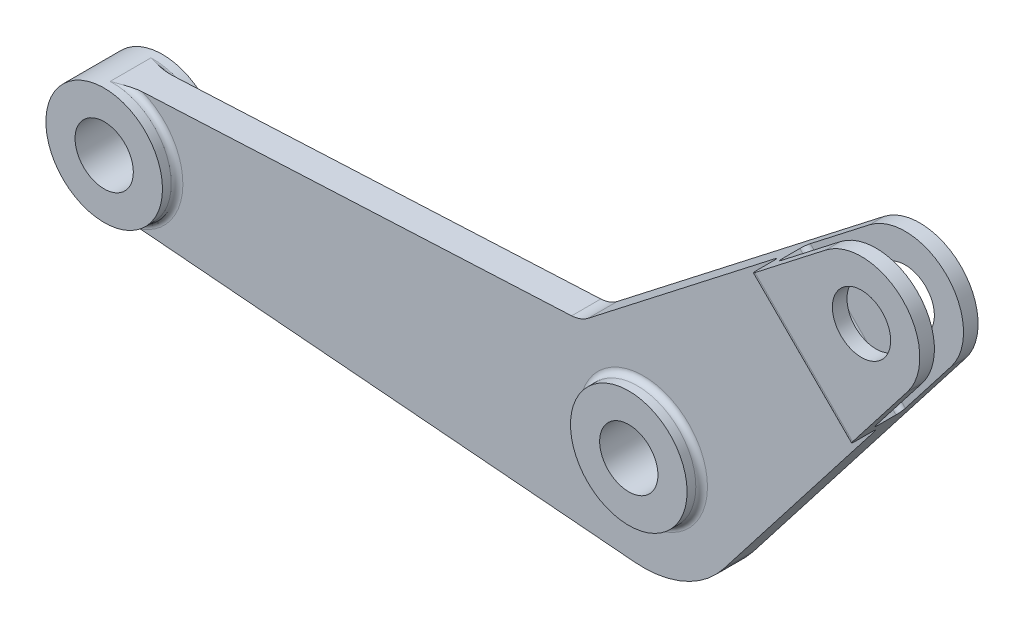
ISO-10303-21;
HEADER;
FILE_DESCRIPTION(('STEP AP214'),'2;1');
FILE_NAME('part.step','',(''),(''),'','','');
FILE_SCHEMA(('AUTOMOTIVE_DESIGN { 1 0 10303 214 1 1 1 1 }'));
ENDSEC;
DATA;
#1=APPLICATION_CONTEXT('core data for automotive mechanical design processes');
#2=APPLICATION_PROTOCOL_DEFINITION('international standard','automotive_design',2000,#1);
#3=PRODUCT_CONTEXT('',#1,'mechanical');
#4=PRODUCT('Part','Part','',(#3));
#5=PRODUCT_RELATED_PRODUCT_CATEGORY('part','',(#4));
#6=PRODUCT_DEFINITION_FORMATION('','',#4);
#7=PRODUCT_DEFINITION_CONTEXT('part definition',#1,'design');
#8=PRODUCT_DEFINITION('design','',#6,#7);
#9=PRODUCT_DEFINITION_SHAPE('','',#8);
#10=(LENGTH_UNIT() NAMED_UNIT(*) SI_UNIT(.MILLI.,.METRE.));
#11=(NAMED_UNIT(*) PLANE_ANGLE_UNIT() SI_UNIT($,.RADIAN.));
#12=(NAMED_UNIT(*) SI_UNIT($,.STERADIAN.) SOLID_ANGLE_UNIT());
#13=UNCERTAINTY_MEASURE_WITH_UNIT(LENGTH_MEASURE(1.E-05),#10,'distance_accuracy_value','');
#14=(GEOMETRIC_REPRESENTATION_CONTEXT(3) GLOBAL_UNCERTAINTY_ASSIGNED_CONTEXT((#13)) GLOBAL_UNIT_ASSIGNED_CONTEXT((#10,
#11,#12)) REPRESENTATION_CONTEXT('',''));
#15=CARTESIAN_POINT('',(0.,0.,0.));
#16=DIRECTION('',(0.,0.,1.));
#17=DIRECTION('',(1.,0.,0.));
#18=AXIS2_PLACEMENT_3D('',#15,#16,#17);
#19=CARTESIAN_POINT('',(84.8528137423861,84.8528137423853,5.));
#20=DIRECTION('',(0.,0.,-1.));
#21=DIRECTION('',(-1.,0.,0.));
#22=AXIS2_PLACEMENT_3D('',#19,#20,#21);
#23=CYLINDRICAL_SURFACE('',#22,20.);
#24=CARTESIAN_POINT('',(84.8528137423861,84.8528137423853,10.));
#25=DIRECTION('',(0.,0.,1.));
#26=DIRECTION('',(1.,0.,0.));
#27=AXIS2_PLACEMENT_3D('',#24,#25,#26);
#28=CIRCLE('',#27,20.);
#29=CARTESIAN_POINT('',(100.651795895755,72.5893654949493,10.));
#30=VERTEX_POINT('',#29);
#31=CARTESIAN_POINT('',(72.5893654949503,100.651795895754,10.));
#32=VERTEX_POINT('',#31);
#33=EDGE_CURVE('E448',#30,#32,#28,.T.);
#34=ORIENTED_EDGE('',*,*,#33,.T.);
#35=DIRECTION('',(0.,0.,-1.));
#36=VECTOR('',#35,1.);
#37=CARTESIAN_POINT('',(72.5893654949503,100.651795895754,5.));
#38=LINE('',#37,#36);
#39=CARTESIAN_POINT('',(72.5893654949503,100.651795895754,15.));
#40=VERTEX_POINT('',#39);
#41=EDGE_CURVE('E198',#40,#32,#38,.T.);
#42=ORIENTED_EDGE('',*,*,#41,.F.);
#43=CARTESIAN_POINT('',(84.8528137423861,84.8528137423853,15.));
#44=DIRECTION('',(0.,0.,1.));
#45=DIRECTION('',(1.,0.,0.));
#46=AXIS2_PLACEMENT_3D('',#43,#44,#45);
#47=CIRCLE('',#46,20.);
#48=CARTESIAN_POINT('',(100.651795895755,72.5893654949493,15.));
#49=VERTEX_POINT('',#48);
#50=EDGE_CURVE('E443',#49,#40,#47,.T.);
#51=ORIENTED_EDGE('',*,*,#50,.F.);
#52=DIRECTION('',(0.,0.,-1.));
#53=VECTOR('',#52,1.);
#54=CARTESIAN_POINT('',(100.651795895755,72.5893654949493,5.));
#55=LINE('',#54,#53);
#56=EDGE_CURVE('E197',#49,#30,#55,.T.);
#57=ORIENTED_EDGE('',*,*,#56,.T.);
#58=EDGE_LOOP('',(#34,#42,#51,#57));
#59=FACE_BOUND('',#58,.T.);
#60=ADVANCED_FACE('F33',(#59),#23,.T.);
#61=CARTESIAN_POINT('',(-180.,0.,5.));
#62=DIRECTION('',(0.,0.,1.));
#63=DIRECTION('',(1.,0.,0.));
#64=AXIS2_PLACEMENT_3D('',#61,#62,#63);
#65=PLANE('',#64);
#66=CARTESIAN_POINT('',(0.,0.,5.));
#67=DIRECTION('',(0.,0.,1.));
#68=DIRECTION('',(1.,0.,0.));
#69=AXIS2_PLACEMENT_3D('',#66,#67,#68);
#70=CIRCLE('',#69,22.);
#71=CARTESIAN_POINT('',(22.,0.,5.));
#72=VERTEX_POINT('',#71);
#73=EDGE_CURVE('E256',#72,#72,#70,.F.);
#74=ORIENTED_EDGE('',*,*,#73,.T.);
#75=EDGE_LOOP('',(#74));
#76=FACE_BOUND('',#75,.T.);
#77=DIRECTION('',(0.6131724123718,0.789949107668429,0.));
#78=VECTOR('',#77,1.);
#79=CARTESIAN_POINT('',(27.648218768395,-21.461034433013,5.));
#80=LINE('',#79,#78);
#81=CARTESIAN_POINT('',(27.648218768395,-21.461034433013,5.));
#82=VERTEX_POINT('',#81);
#83=CARTESIAN_POINT('',(79.3301162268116,45.1206772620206,5.));
#84=VERTEX_POINT('',#83);
#85=EDGE_CURVE('E378',#82,#84,#80,.T.);
#86=ORIENTED_EDGE('',*,*,#85,.T.);
#87=DIRECTION('',(-0.707106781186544,0.707106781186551,0.));
#88=VECTOR('',#87,1.);
#89=CARTESIAN_POINT('',(-27.7746032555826,152.225396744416,5.));
#90=LINE('',#89,#88);
#91=CARTESIAN_POINT('',(45.1206772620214,79.3301162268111,5.));
#92=VERTEX_POINT('',#91);
#93=EDGE_CURVE('E259',#84,#92,#90,.T.);
#94=ORIENTED_EDGE('',*,*,#93,.T.);
#95=DIRECTION('',(-0.789949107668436,-0.613172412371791,0.));
#96=VECTOR('',#95,1.);
#97=CARTESIAN_POINT('',(-21.4610344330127,27.6482187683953,5.));
#98=LINE('',#97,#96);
#99=CARTESIAN_POINT('',(-18.9653568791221,29.5854076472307,5.));
#100=VERTEX_POINT('',#99);
#101=EDGE_CURVE('E398',#92,#100,#98,.T.);
#102=ORIENTED_EDGE('',*,*,#101,.T.);
#103=CARTESIAN_POINT('',(-25.09708100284,37.484898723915,5.));
#104=DIRECTION('',(0.,0.,1.));
#105=DIRECTION('',(1.,0.,0.));
#106=AXIS2_PLACEMENT_3D('',#103,#104,#105);
#107=CIRCLE('',#106,10.);
#108=CARTESIAN_POINT('',(-24.6166757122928,27.4964448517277,5.));
#109=VERTEX_POINT('',#108);
#110=EDGE_CURVE('E11',#100,#109,#107,.F.);
#111=ORIENTED_EDGE('',*,*,#110,.T.);
#112=DIRECTION('',(-0.998845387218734,-0.0480405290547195,0.));
#113=VECTOR('',#112,1.);
#114=CARTESIAN_POINT('',(-21.4610344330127,27.6482187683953,5.));
#115=LINE('',#114,#113);
#116=CARTESIAN_POINT('',(-171.80624139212,20.4172064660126,5.));
#117=VERTEX_POINT('',#116);
#118=EDGE_CURVE('E384',#109,#117,#115,.T.);
#119=ORIENTED_EDGE('',*,*,#118,.T.);
#120=CARTESIAN_POINT('',(-180.,0.,5.));
#121=DIRECTION('',(0.,0.,1.));
#122=DIRECTION('',(1.,0.,0.));
#123=AXIS2_PLACEMENT_3D('',#120,#121,#122);
#124=CIRCLE('',#123,22.);
#125=CARTESIAN_POINT('',(-172.533394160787,-20.6941971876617,5.));
#126=VERTEX_POINT('',#125);
#127=EDGE_CURVE('E253',#117,#126,#124,.F.);
#128=ORIENTED_EDGE('',*,*,#127,.T.);
#129=DIRECTION('',(0.996521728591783,-0.0833333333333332,0.));
#130=VECTOR('',#129,1.);
#131=CARTESIAN_POINT('',(-181.666666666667,-19.9304345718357,5.));
#132=LINE('',#131,#130);
#133=CARTESIAN_POINT('',(-2.91666666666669,-34.8782605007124,5.));
#134=VERTEX_POINT('',#133);
#135=EDGE_CURVE('E385',#126,#134,#132,.T.);
#136=ORIENTED_EDGE('',*,*,#135,.T.);
#137=CARTESIAN_POINT('',(0.,0.,5.));
#138=DIRECTION('',(0.,0.,1.));
#139=DIRECTION('',(1.,0.,0.));
#140=AXIS2_PLACEMENT_3D('',#137,#138,#139);
#141=CIRCLE('',#140,35.);
#142=EDGE_CURVE('E390',#134,#82,#141,.T.);
#143=ORIENTED_EDGE('',*,*,#142,.T.);
#144=EDGE_LOOP('',(#86,#94,#102,#111,#119,#128,#136,#143));
#145=FACE_BOUND('',#144,.T.);
#146=ADVANCED_FACE('F345',(#76,#145),#65,.T.);
#147=CARTESIAN_POINT('',(-21.4610344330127,27.6482187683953,5.));
#148=DIRECTION('',(0.0480405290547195,-0.998845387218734,0.));
#149=DIRECTION('',(0.998845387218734,0.0480405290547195,0.));
#150=AXIS2_PLACEMENT_3D('',#147,#148,#149);
#151=PLANE('',#150);
#152=ORIENTED_EDGE('',*,*,#118,.F.);
#153=DIRECTION('',(0.,0.,-1.));
#154=VECTOR('',#153,1.);
#155=CARTESIAN_POINT('',(-24.6166757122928,27.4964448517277,-5.));
#156=LINE('',#155,#154);
#157=CARTESIAN_POINT('',(-24.6166757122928,27.4964448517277,-5.));
#158=VERTEX_POINT('',#157);
#159=EDGE_CURVE('E411',#109,#158,#156,.T.);
#160=ORIENTED_EDGE('',*,*,#159,.T.);
#161=DIRECTION('',(-0.998845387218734,-0.0480405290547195,0.));
#162=VECTOR('',#161,1.);
#163=CARTESIAN_POINT('',(-21.4610344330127,27.6482187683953,-5.));
#164=LINE('',#163,#162);
#165=CARTESIAN_POINT('',(-171.80624139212,20.4172064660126,-5.));
#166=VERTEX_POINT('',#165);
#167=EDGE_CURVE('E400',#158,#166,#164,.T.);
#168=ORIENTED_EDGE('',*,*,#167,.T.);
#169=CARTESIAN_POINT('',(-171.80624139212,20.4172064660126,-5.));
#170=CARTESIAN_POINT('',(-171.975211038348,20.409079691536,-5.00002700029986));
#171=CARTESIAN_POINT('',(-172.144144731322,20.4009546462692,-5.00372364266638));
#172=CARTESIAN_POINT('',(-172.481686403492,20.3847202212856,-5.01764297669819));
#173=CARTESIAN_POINT('',(-172.650294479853,20.3766108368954,-5.02786326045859));
#174=CARTESIAN_POINT('',(-172.986775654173,20.3604274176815,-5.05399608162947));
#175=CARTESIAN_POINT('',(-173.154649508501,20.3523533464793,-5.06989911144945));
#176=CARTESIAN_POINT('',(-173.489853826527,20.336231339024,-5.10675267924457));
#177=CARTESIAN_POINT('',(-173.657184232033,20.3281834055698,-5.12770374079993));
#178=CARTESIAN_POINT('',(-174.156249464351,20.3041803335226,-5.19697248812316));
#179=CARTESIAN_POINT('',(-174.487078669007,20.2882687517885,-5.25187726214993));
#180=CARTESIAN_POINT('',(-175.146228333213,20.256566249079,-5.37560501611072));
#181=CARTESIAN_POINT('',(-175.474547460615,20.2407753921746,-5.44443491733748));
#182=CARTESIAN_POINT('',(-176.235285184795,20.2041869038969,-5.61719451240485));
#183=CARTESIAN_POINT('',(-176.666761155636,20.1834346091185,-5.72525296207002));
#184=CARTESIAN_POINT('',(-177.526162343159,20.1421007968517,-5.95477561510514));
#185=CARTESIAN_POINT('',(-177.954086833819,20.1215193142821,-6.07624249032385));
#186=CARTESIAN_POINT('',(-179.235222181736,20.0599017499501,-6.45375068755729));
#187=CARTESIAN_POINT('',(-180.084608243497,20.0190496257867,-6.72260082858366));
#188=CARTESIAN_POINT('',(-180.942852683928,19.9777714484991,-6.99431466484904));
#189=CARTESIAN_POINT('',(-180.951831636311,19.9773395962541,-6.99715734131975));
#190=CARTESIAN_POINT('',(-180.960810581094,19.9769077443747,-7.));
#191=B_SPLINE_CURVE_WITH_KNOTS('',3,(#169,#170,#171,#172,#173,#174,#175,#176,#177,#178,#179,
#180,#181,#182,#183,#184,#185,#186,#187,#188,#189,#190),.UNSPECIFIED.,.F.,.F.,(4,2,2,2,2,2,2,2,
2,2,4),(0.,0.507403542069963,1.01461990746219,1.52099161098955,2.02741585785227,
3.03418305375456,4.04145188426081,5.37696765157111,6.71275002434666,9.38798628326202,
9.41627055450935),.UNSPECIFIED.);
#192=CARTESIAN_POINT('',(-180.960810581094,19.9769077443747,-7.));
#193=VERTEX_POINT('',#192);
#194=EDGE_CURVE('E301',#166,#193,#191,.T.);
#195=ORIENTED_EDGE('',*,*,#194,.T.);
#196=DIRECTION('',(0.,0.,-1.));
#197=VECTOR('',#196,1.);
#198=CARTESIAN_POINT('',(-180.960810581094,19.9769077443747,5.));
#199=LINE('',#198,#197);
#200=CARTESIAN_POINT('',(-180.960810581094,19.9769077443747,7.));
#201=VERTEX_POINT('',#200);
#202=EDGE_CURVE('E212',#201,#193,#199,.T.);
#203=ORIENTED_EDGE('',*,*,#202,.F.);
#204=CARTESIAN_POINT('',(-171.80624139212,20.4172064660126,5.));
#205=CARTESIAN_POINT('',(-171.975211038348,20.409079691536,5.00002700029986));
#206=CARTESIAN_POINT('',(-172.144144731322,20.4009546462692,5.00372364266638));
#207=CARTESIAN_POINT('',(-172.481686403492,20.3847202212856,5.01764297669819));
#208=CARTESIAN_POINT('',(-172.650294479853,20.3766108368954,5.02786326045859));
#209=CARTESIAN_POINT('',(-172.986775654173,20.3604274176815,5.05399608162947));
#210=CARTESIAN_POINT('',(-173.154649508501,20.3523533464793,5.06989911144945));
#211=CARTESIAN_POINT('',(-173.489853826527,20.336231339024,5.10675267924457));
#212=CARTESIAN_POINT('',(-173.657184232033,20.3281834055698,5.12770374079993));
#213=CARTESIAN_POINT('',(-174.156249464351,20.3041803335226,5.19697248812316));
#214=CARTESIAN_POINT('',(-174.487078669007,20.2882687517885,5.25187726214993));
#215=CARTESIAN_POINT('',(-175.146228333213,20.256566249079,5.37560501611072));
#216=CARTESIAN_POINT('',(-175.474547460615,20.2407753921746,5.44443491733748));
#217=CARTESIAN_POINT('',(-176.235285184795,20.2041869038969,5.61719451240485));
#218=CARTESIAN_POINT('',(-176.666761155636,20.1834346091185,5.72525296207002));
#219=CARTESIAN_POINT('',(-177.526162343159,20.1421007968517,5.95477561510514));
#220=CARTESIAN_POINT('',(-177.954086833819,20.1215193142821,6.07624249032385));
#221=CARTESIAN_POINT('',(-179.235222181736,20.0599017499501,6.45375068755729));
#222=CARTESIAN_POINT('',(-180.084608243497,20.0190496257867,6.72260082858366));
#223=CARTESIAN_POINT('',(-180.942852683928,19.9777714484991,6.99431466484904));
#224=CARTESIAN_POINT('',(-180.951831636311,19.9773395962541,6.99715734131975));
#225=CARTESIAN_POINT('',(-180.960810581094,19.9769077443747,7.));
#226=B_SPLINE_CURVE_WITH_KNOTS('',3,(#204,#205,#206,#207,#208,#209,#210,#211,#212,#213,#214,
#215,#216,#217,#218,#219,#220,#221,#222,#223,#224,#225),.UNSPECIFIED.,.F.,.F.,(4,2,2,2,2,2,2,2,
2,2,4),(0.,0.507403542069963,1.01461990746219,1.52099161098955,2.02741585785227,
3.03418305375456,4.04145188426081,5.37696765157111,6.71275002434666,9.38798628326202,
9.41627055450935),.UNSPECIFIED.);
#227=EDGE_CURVE('E326',#201,#117,#226,.F.);
#228=ORIENTED_EDGE('',*,*,#227,.T.);
#229=EDGE_LOOP('',(#152,#160,#168,#195,#203,#228));
#230=FACE_BOUND('',#229,.T.);
#231=ADVANCED_FACE('F351',(#230),#151,.F.);
#232=CARTESIAN_POINT('',(-180.,0.,5.));
#233=DIRECTION('',(0.,0.,-1.));
#234=DIRECTION('',(-1.,0.,0.));
#235=AXIS2_PLACEMENT_3D('',#232,#233,#234);
#236=CYLINDRICAL_SURFACE('',#235,20.);
#237=CARTESIAN_POINT('',(-180.,0.,-7.));
#238=DIRECTION('',(0.,0.,1.));
#239=DIRECTION('',(1.,0.,0.));
#240=AXIS2_PLACEMENT_3D('',#237,#238,#239);
#241=CIRCLE('',#240,20.);
#242=CARTESIAN_POINT('',(-181.666666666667,-19.9304345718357,-7.));
#243=VERTEX_POINT('',#242);
#244=EDGE_CURVE('E279',#193,#243,#241,.F.);
#245=ORIENTED_EDGE('',*,*,#244,.T.);
#246=DIRECTION('',(0.,0.,-1.));
#247=VECTOR('',#246,1.);
#248=CARTESIAN_POINT('',(-181.666666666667,-19.9304345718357,5.));
#249=LINE('',#248,#247);
#250=CARTESIAN_POINT('',(-181.666666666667,-19.9304345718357,7.));
#251=VERTEX_POINT('',#250);
#252=EDGE_CURVE('E210',#251,#243,#249,.T.);
#253=ORIENTED_EDGE('',*,*,#252,.F.);
#254=CARTESIAN_POINT('',(-180.,0.,7.));
#255=DIRECTION('',(0.,0.,1.));
#256=DIRECTION('',(1.,0.,0.));
#257=AXIS2_PLACEMENT_3D('',#254,#255,#256);
#258=CIRCLE('',#257,20.);
#259=EDGE_CURVE('E276',#251,#201,#258,.T.);
#260=ORIENTED_EDGE('',*,*,#259,.T.);
#261=ORIENTED_EDGE('',*,*,#202,.T.);
#262=EDGE_LOOP('',(#245,#253,#260,#261));
#263=FACE_BOUND('',#262,.T.);
#264=CARTESIAN_POINT('',(-180.,0.,-10.));
#265=DIRECTION('',(0.,0.,1.));
#266=DIRECTION('',(1.,0.,0.));
#267=AXIS2_PLACEMENT_3D('',#264,#265,#266);
#268=CIRCLE('',#267,20.);
#269=CARTESIAN_POINT('',(-160.,0.,-10.));
#270=VERTEX_POINT('',#269);
#271=EDGE_CURVE('E393',#270,#270,#268,.T.);
#272=ORIENTED_EDGE('',*,*,#271,.T.);
#273=EDGE_LOOP('',(#272));
#274=FACE_BOUND('',#273,.T.);
#275=CARTESIAN_POINT('',(-180.,0.,10.));
#276=DIRECTION('',(0.,0.,1.));
#277=DIRECTION('',(1.,0.,0.));
#278=AXIS2_PLACEMENT_3D('',#275,#276,#277);
#279=CIRCLE('',#278,20.);
#280=CARTESIAN_POINT('',(-160.,0.,10.));
#281=VERTEX_POINT('',#280);
#282=EDGE_CURVE('E401',#281,#281,#279,.T.);
#283=ORIENTED_EDGE('',*,*,#282,.F.);
#284=EDGE_LOOP('',(#283));
#285=FACE_BOUND('',#284,.T.);
#286=ADVANCED_FACE('F316',(#263,#274,#285),#236,.T.);
#287=CARTESIAN_POINT('',(-181.666666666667,-19.9304345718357,5.));
#288=DIRECTION('',(0.0833333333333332,0.996521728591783,0.));
#289=DIRECTION('',(-0.996521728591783,0.0833333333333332,0.));
#290=AXIS2_PLACEMENT_3D('',#287,#288,#289);
#291=PLANE('',#290);
#292=ORIENTED_EDGE('',*,*,#252,.T.);
#293=CARTESIAN_POINT('',(-172.533394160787,-20.6941971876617,-5.));
#294=CARTESIAN_POINT('',(-172.701970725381,-20.68010010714,-5.00002700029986));
#295=CARTESIAN_POINT('',(-172.870511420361,-20.6660060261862,-5.00372364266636));
#296=CARTESIAN_POINT('',(-173.207267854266,-20.637845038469,-5.01764297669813));
#297=CARTESIAN_POINT('',(-173.37548369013,-20.6237781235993,-5.02786326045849));
#298=CARTESIAN_POINT('',(-173.711182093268,-20.5957056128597,-5.05399608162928));
#299=CARTESIAN_POINT('',(-173.878665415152,-20.5816999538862,-5.06989911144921));
#300=CARTESIAN_POINT('',(-174.213089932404,-20.5537339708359,-5.10675267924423));
#301=CARTESIAN_POINT('',(-174.380031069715,-20.5397736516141,-5.12770374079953));
#302=CARTESIAN_POINT('',(-174.877935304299,-20.4981368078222,-5.19697248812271));
#303=CARTESIAN_POINT('',(-175.207994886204,-20.4705358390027,-5.25187726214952));
#304=CARTESIAN_POINT('',(-175.865611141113,-20.4155432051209,-5.37560501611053));
#305=CARTESIAN_POINT('',(-176.193166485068,-20.3881516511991,-5.44443491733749));
#306=CARTESIAN_POINT('',(-176.952134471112,-20.3246835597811,-5.61719451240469));
#307=CARTESIAN_POINT('',(-177.382606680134,-20.2886856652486,-5.72525296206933));
#308=CARTESIAN_POINT('',(-178.240008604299,-20.2169861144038,-5.95477561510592));
#309=CARTESIAN_POINT('',(-178.666937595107,-20.1812845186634,-6.07624249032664));
#310=CARTESIAN_POINT('',(-179.945092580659,-20.0743998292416,-6.45375068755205));
#311=CARTESIAN_POINT('',(-180.792502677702,-20.0035358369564,-6.72260082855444));
#312=CARTESIAN_POINT('',(-181.648750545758,-19.9319327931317,-6.99431466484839));
#313=CARTESIAN_POINT('',(-181.657708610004,-19.9311836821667,-6.99715734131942));
#314=CARTESIAN_POINT('',(-181.666666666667,-19.9304345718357,-7.));
#315=B_SPLINE_CURVE_WITH_KNOTS('',3,(#293,#294,#295,#296,#297,#298,#299,#300,#301,#302,#303,
#304,#305,#306,#307,#308,#309,#310,#311,#312,#313,#314),.UNSPECIFIED.,.F.,.F.,(4,2,2,2,2,2,2,2,
2,2,4),(0.,0.507403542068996,1.01461990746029,1.52099161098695,2.02741585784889,
3.03418305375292,4.04145188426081,5.37696765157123,6.71275002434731,9.38798628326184,
9.41627055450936),.UNSPECIFIED.);
#316=CARTESIAN_POINT('',(-172.533394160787,-20.6941971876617,-5.));
#317=VERTEX_POINT('',#316);
#318=EDGE_CURVE('E294',#243,#317,#315,.F.);
#319=ORIENTED_EDGE('',*,*,#318,.T.);
#320=DIRECTION('',(0.996521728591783,-0.0833333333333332,0.));
#321=VECTOR('',#320,1.);
#322=CARTESIAN_POINT('',(-181.666666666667,-19.9304345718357,-5.));
#323=LINE('',#322,#321);
#324=CARTESIAN_POINT('',(-2.91666666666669,-34.8782605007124,-5.));
#325=VERTEX_POINT('',#324);
#326=EDGE_CURVE('E375',#317,#325,#323,.T.);
#327=ORIENTED_EDGE('',*,*,#326,.T.);
#328=DIRECTION('',(0.,0.,-1.));
#329=VECTOR('',#328,1.);
#330=CARTESIAN_POINT('',(-2.91666666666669,-34.8782605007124,5.));
#331=LINE('',#330,#329);
#332=EDGE_CURVE('E207',#134,#325,#331,.T.);
#333=ORIENTED_EDGE('',*,*,#332,.F.);
#334=ORIENTED_EDGE('',*,*,#135,.F.);
#335=CARTESIAN_POINT('',(-172.533394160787,-20.6941971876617,5.));
#336=CARTESIAN_POINT('',(-172.701970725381,-20.68010010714,5.00002700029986));
#337=CARTESIAN_POINT('',(-172.870511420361,-20.6660060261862,5.00372364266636));
#338=CARTESIAN_POINT('',(-173.207267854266,-20.637845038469,5.01764297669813));
#339=CARTESIAN_POINT('',(-173.37548369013,-20.6237781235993,5.02786326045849));
#340=CARTESIAN_POINT('',(-173.711182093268,-20.5957056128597,5.05399608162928));
#341=CARTESIAN_POINT('',(-173.878665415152,-20.5816999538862,5.06989911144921));
#342=CARTESIAN_POINT('',(-174.213089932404,-20.5537339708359,5.10675267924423));
#343=CARTESIAN_POINT('',(-174.380031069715,-20.5397736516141,5.12770374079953));
#344=CARTESIAN_POINT('',(-174.877935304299,-20.4981368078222,5.19697248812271));
#345=CARTESIAN_POINT('',(-175.207994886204,-20.4705358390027,5.25187726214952));
#346=CARTESIAN_POINT('',(-175.865611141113,-20.4155432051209,5.37560501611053));
#347=CARTESIAN_POINT('',(-176.193166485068,-20.3881516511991,5.44443491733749));
#348=CARTESIAN_POINT('',(-176.952134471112,-20.3246835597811,5.61719451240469));
#349=CARTESIAN_POINT('',(-177.382606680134,-20.2886856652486,5.72525296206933));
#350=CARTESIAN_POINT('',(-178.240008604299,-20.2169861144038,5.95477561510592));
#351=CARTESIAN_POINT('',(-178.666937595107,-20.1812845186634,6.07624249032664));
#352=CARTESIAN_POINT('',(-179.945092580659,-20.0743998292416,6.45375068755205));
#353=CARTESIAN_POINT('',(-180.792502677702,-20.0035358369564,6.72260082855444));
#354=CARTESIAN_POINT('',(-181.648750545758,-19.9319327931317,6.99431466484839));
#355=CARTESIAN_POINT('',(-181.657708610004,-19.9311836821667,6.99715734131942));
#356=CARTESIAN_POINT('',(-181.666666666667,-19.9304345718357,7.));
#357=B_SPLINE_CURVE_WITH_KNOTS('',3,(#335,#336,#337,#338,#339,#340,#341,#342,#343,#344,#345,
#346,#347,#348,#349,#350,#351,#352,#353,#354,#355,#356),.UNSPECIFIED.,.F.,.F.,(4,2,2,2,2,2,2,2,
2,2,4),(0.,0.507403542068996,1.01461990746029,1.52099161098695,2.02741585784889,
3.03418305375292,4.04145188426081,5.37696765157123,6.71275002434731,9.38798628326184,
9.41627055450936),.UNSPECIFIED.);
#358=EDGE_CURVE('E320',#126,#251,#357,.T.);
#359=ORIENTED_EDGE('',*,*,#358,.T.);
#360=EDGE_LOOP('',(#292,#319,#327,#333,#334,#359));
#361=FACE_BOUND('',#360,.T.);
#362=ADVANCED_FACE('F310',(#361),#291,.F.);
#363=CARTESIAN_POINT('',(0.,0.,5.));
#364=DIRECTION('',(0.,0.,-1.));
#365=DIRECTION('',(-1.,0.,0.));
#366=AXIS2_PLACEMENT_3D('',#363,#364,#365);
#367=CYLINDRICAL_SURFACE('',#366,35.);
#368=CARTESIAN_POINT('',(0.,0.,-5.));
#369=DIRECTION('',(0.,0.,1.));
#370=DIRECTION('',(1.,0.,0.));
#371=AXIS2_PLACEMENT_3D('',#368,#369,#370);
#372=CIRCLE('',#371,35.);
#373=CARTESIAN_POINT('',(27.648218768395,-21.461034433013,-5.));
#374=VERTEX_POINT('',#373);
#375=EDGE_CURVE('E370',#325,#374,#372,.T.);
#376=ORIENTED_EDGE('',*,*,#375,.T.);
#377=DIRECTION('',(0.,0.,-1.));
#378=VECTOR('',#377,1.);
#379=CARTESIAN_POINT('',(27.648218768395,-21.461034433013,5.));
#380=LINE('',#379,#378);
#381=EDGE_CURVE('E201',#82,#374,#380,.T.);
#382=ORIENTED_EDGE('',*,*,#381,.F.);
#383=ORIENTED_EDGE('',*,*,#142,.F.);
#384=ORIENTED_EDGE('',*,*,#332,.T.);
#385=EDGE_LOOP('',(#376,#382,#383,#384));
#386=FACE_BOUND('',#385,.T.);
#387=ADVANCED_FACE('F315',(#386),#367,.T.);
#388=CARTESIAN_POINT('',(27.648218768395,-21.461034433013,5.));
#389=DIRECTION('',(-0.789949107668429,0.6131724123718,0.));
#390=DIRECTION('',(-0.6131724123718,-0.789949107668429,0.));
#391=AXIS2_PLACEMENT_3D('',#388,#389,#390);
#392=PLANE('',#391);
#393=DIRECTION('',(0.613172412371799,0.789949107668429,0.));
#394=VECTOR('',#393,1.);
#395=CARTESIAN_POINT('',(80.5661556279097,46.7130649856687,15.));
#396=LINE('',#395,#394);
#397=CARTESIAN_POINT('',(81.8021950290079,48.3054527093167,15.));
#398=VERTEX_POINT('',#397);
#399=EDGE_CURVE('E438',#398,#49,#396,.T.);
#400=ORIENTED_EDGE('',*,*,#399,.F.);
#401=CARTESIAN_POINT('',(81.8021950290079,48.3054527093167,13.));
#402=DIRECTION('',(-0.789949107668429,0.6131724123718,0.));
#403=DIRECTION('',(0.6131724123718,0.789949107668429,0.));
#404=AXIS2_PLACEMENT_3D('',#401,#402,#403);
#405=ELLIPSE('',#404,2.01581052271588,2.);
#406=CARTESIAN_POINT('',(80.5661556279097,46.7130649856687,13.));
#407=VERTEX_POINT('',#406);
#408=EDGE_CURVE('E269',#398,#407,#405,.F.);
#409=ORIENTED_EDGE('',*,*,#408,.T.);
#410=DIRECTION('',(0.,0.,-1.));
#411=VECTOR('',#410,1.);
#412=CARTESIAN_POINT('',(80.5661556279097,46.7130649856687,15.));
#413=LINE('',#412,#411);
#414=CARTESIAN_POINT('',(80.5661556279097,46.7130649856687,7.));
#415=VERTEX_POINT('',#414);
#416=EDGE_CURVE('E435',#407,#415,#413,.T.);
#417=ORIENTED_EDGE('',*,*,#416,.T.);
#418=CARTESIAN_POINT('',(79.3301162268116,45.1206772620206,7.));
#419=DIRECTION('',(-0.789949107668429,0.6131724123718,0.));
#420=DIRECTION('',(0.6131724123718,0.789949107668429,0.));
#421=AXIS2_PLACEMENT_3D('',#418,#419,#420);
#422=ELLIPSE('',#421,2.01581052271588,2.);
#423=EDGE_CURVE('E292',#415,#84,#422,.T.);
#424=ORIENTED_EDGE('',*,*,#423,.T.);
#425=ORIENTED_EDGE('',*,*,#85,.F.);
#426=ORIENTED_EDGE('',*,*,#381,.T.);
#427=DIRECTION('',(0.6131724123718,0.789949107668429,0.));
#428=VECTOR('',#427,1.);
#429=CARTESIAN_POINT('',(27.648218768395,-21.461034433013,-5.));
#430=LINE('',#429,#428);
#431=CARTESIAN_POINT('',(100.651795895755,72.5893654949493,-5.));
#432=VERTEX_POINT('',#431);
#433=EDGE_CURVE('E195',#374,#432,#430,.T.);
#434=ORIENTED_EDGE('',*,*,#433,.T.);
#435=CARTESIAN_POINT('',(100.651795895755,72.5893654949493,0.));
#436=VERTEX_POINT('',#435);
#437=EDGE_CURVE('E186',#436,#432,#55,.T.);
#438=ORIENTED_EDGE('',*,*,#437,.F.);
#439=DIRECTION('',(-0.6131724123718,-0.78994910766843,0.));
#440=VECTOR('',#439,1.);
#441=CARTESIAN_POINT('',(27.648218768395,-21.461034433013,0.));
#442=LINE('',#441,#440);
#443=CARTESIAN_POINT('',(84.8922935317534,52.286422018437,0.));
#444=VERTEX_POINT('',#443);
#445=EDGE_CURVE('E170',#436,#444,#442,.T.);
#446=ORIENTED_EDGE('',*,*,#445,.T.);
#447=CARTESIAN_POINT('',(84.8922935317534,52.286422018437,2.));
#448=DIRECTION('',(-0.789949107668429,0.6131724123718,0.));
#449=DIRECTION('',(-0.6131724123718,-0.789949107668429,0.));
#450=AXIS2_PLACEMENT_3D('',#447,#448,#449);
#451=ELLIPSE('',#450,2.01581052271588,2.);
#452=CARTESIAN_POINT('',(83.6562541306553,50.6940342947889,2.00000000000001));
#453=VERTEX_POINT('',#452);
#454=EDGE_CURVE('E288',#444,#453,#451,.T.);
#455=ORIENTED_EDGE('',*,*,#454,.T.);
#456=DIRECTION('',(0.,0.,1.));
#457=VECTOR('',#456,1.);
#458=CARTESIAN_POINT('',(83.6562541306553,50.6940342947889,5.));
#459=LINE('',#458,#457);
#460=CARTESIAN_POINT('',(83.6562541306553,50.6940342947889,8.));
#461=VERTEX_POINT('',#460);
#462=EDGE_CURVE('E181',#453,#461,#459,.T.);
#463=ORIENTED_EDGE('',*,*,#462,.T.);
#464=CARTESIAN_POINT('',(84.8922935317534,52.286422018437,8.00000000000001));
#465=DIRECTION('',(-0.789949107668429,0.6131724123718,0.));
#466=DIRECTION('',(-0.6131724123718,-0.789949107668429,0.));
#467=AXIS2_PLACEMENT_3D('',#464,#465,#466);
#468=ELLIPSE('',#467,2.01581052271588,2.);
#469=CARTESIAN_POINT('',(84.8922935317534,52.286422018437,10.));
#470=VERTEX_POINT('',#469);
#471=EDGE_CURVE('E284',#461,#470,#468,.T.);
#472=ORIENTED_EDGE('',*,*,#471,.T.);
#473=DIRECTION('',(0.6131724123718,0.78994910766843,0.));
#474=VECTOR('',#473,1.);
#475=CARTESIAN_POINT('',(27.648218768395,-21.461034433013,10.));
#476=LINE('',#475,#474);
#477=EDGE_CURVE('E446',#470,#30,#476,.T.);
#478=ORIENTED_EDGE('',*,*,#477,.T.);
#479=ORIENTED_EDGE('',*,*,#56,.F.);
#480=EDGE_LOOP('',(#400,#409,#417,#424,#425,#426,#434,#438,#446,#455,#463,#472,#478,#479));
#481=FACE_BOUND('',#480,.T.);
#482=ADVANCED_FACE('F192',(#481),#392,.F.);
#483=CARTESIAN_POINT('',(72.5893654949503,100.651795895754,0.));
#484=VERTEX_POINT('',#483);
#485=CARTESIAN_POINT('',(72.5893654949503,100.651795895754,-5.));
#486=VERTEX_POINT('',#485);
#487=EDGE_CURVE('E188',#484,#486,#38,.T.);
#488=ORIENTED_EDGE('',*,*,#487,.F.);
#489=CARTESIAN_POINT('',(84.8528137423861,84.8528137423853,0.));
#490=DIRECTION('',(0.,0.,-1.));
#491=DIRECTION('',(-1.,0.,0.));
#492=AXIS2_PLACEMENT_3D('',#489,#490,#491);
#493=CIRCLE('',#492,20.);
#494=EDGE_CURVE('E174',#484,#436,#493,.T.);
#495=ORIENTED_EDGE('',*,*,#494,.T.);
#496=ORIENTED_EDGE('',*,*,#437,.T.);
#497=CARTESIAN_POINT('',(84.8528137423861,84.8528137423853,-5.));
#498=DIRECTION('',(0.,0.,1.));
#499=DIRECTION('',(1.,0.,0.));
#500=AXIS2_PLACEMENT_3D('',#497,#498,#499);
#501=CIRCLE('',#500,20.);
#502=EDGE_CURVE('E379',#432,#486,#501,.T.);
#503=ORIENTED_EDGE('',*,*,#502,.T.);
#504=EDGE_LOOP('',(#488,#495,#496,#503));
#505=FACE_BOUND('',#504,.T.);
#506=ADVANCED_FACE('F184',(#505),#23,.T.);
#507=CARTESIAN_POINT('',(-21.4610344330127,27.6482187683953,5.));
#508=DIRECTION('',(0.613172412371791,-0.789949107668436,0.));
#509=DIRECTION('',(0.789949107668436,0.613172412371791,0.));
#510=AXIS2_PLACEMENT_3D('',#507,#508,#509);
#511=PLANE('',#510);
#512=DIRECTION('',(-0.789949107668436,-0.613172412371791,0.));
#513=VECTOR('',#512,1.);
#514=CARTESIAN_POINT('',(-21.4610344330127,27.6482187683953,-5.));
#515=LINE('',#514,#513);
#516=CARTESIAN_POINT('',(-18.9653568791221,29.5854076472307,-5.));
#517=VERTEX_POINT('',#516);
#518=EDGE_CURVE('E381',#486,#517,#515,.T.);
#519=ORIENTED_EDGE('',*,*,#518,.T.);
#520=DIRECTION('',(0.,0.,-1.));
#521=VECTOR('',#520,1.);
#522=CARTESIAN_POINT('',(-18.9653568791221,29.5854076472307,5.));
#523=LINE('',#522,#521);
#524=EDGE_CURVE('E48',#517,#100,#523,.F.);
#525=ORIENTED_EDGE('',*,*,#524,.T.);
#526=ORIENTED_EDGE('',*,*,#101,.F.);
#527=CARTESIAN_POINT('',(45.1206772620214,79.3301162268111,7.));
#528=DIRECTION('',(0.613172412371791,-0.789949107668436,0.));
#529=DIRECTION('',(-0.789949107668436,-0.613172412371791,0.));
#530=AXIS2_PLACEMENT_3D('',#527,#528,#529);
#531=ELLIPSE('',#530,2.01581052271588,2.);
#532=CARTESIAN_POINT('',(46.7130649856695,80.5661556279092,7.));
#533=VERTEX_POINT('',#532);
#534=EDGE_CURVE('E290',#92,#533,#531,.T.);
#535=ORIENTED_EDGE('',*,*,#534,.T.);
#536=DIRECTION('',(0.,0.,-1.));
#537=VECTOR('',#536,1.);
#538=CARTESIAN_POINT('',(46.7130649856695,80.5661556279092,15.));
#539=LINE('',#538,#537);
#540=CARTESIAN_POINT('',(46.7130649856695,80.5661556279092,13.));
#541=VERTEX_POINT('',#540);
#542=EDGE_CURVE('E430',#541,#533,#539,.T.);
#543=ORIENTED_EDGE('',*,*,#542,.F.);
#544=CARTESIAN_POINT('',(48.3054527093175,81.8021950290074,13.));
#545=DIRECTION('',(0.613172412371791,-0.789949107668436,0.));
#546=DIRECTION('',(-0.789949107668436,-0.613172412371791,0.));
#547=AXIS2_PLACEMENT_3D('',#544,#545,#546);
#548=ELLIPSE('',#547,2.01581052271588,2.);
#549=CARTESIAN_POINT('',(48.3054527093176,81.8021950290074,15.));
#550=VERTEX_POINT('',#549);
#551=EDGE_CURVE('E271',#541,#550,#548,.F.);
#552=ORIENTED_EDGE('',*,*,#551,.T.);
#553=DIRECTION('',(-0.789949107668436,-0.613172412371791,0.));
#554=VECTOR('',#553,1.);
#555=CARTESIAN_POINT('',(72.5893654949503,100.651795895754,15.));
#556=LINE('',#555,#554);
#557=EDGE_CURVE('E440',#40,#550,#556,.T.);
#558=ORIENTED_EDGE('',*,*,#557,.F.);
#559=ORIENTED_EDGE('',*,*,#41,.T.);
#560=DIRECTION('',(-0.789949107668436,-0.613172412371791,0.));
#561=VECTOR('',#560,1.);
#562=CARTESIAN_POINT('',(-21.4610344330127,27.6482187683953,10.));
#563=LINE('',#562,#561);
#564=CARTESIAN_POINT('',(52.2864220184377,84.8922935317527,10.));
#565=VERTEX_POINT('',#564);
#566=EDGE_CURVE('E219',#32,#565,#563,.T.);
#567=ORIENTED_EDGE('',*,*,#566,.T.);
#568=CARTESIAN_POINT('',(52.2864220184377,84.8922935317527,8.00000000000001));
#569=DIRECTION('',(0.613172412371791,-0.789949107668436,0.));
#570=DIRECTION('',(0.789949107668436,0.613172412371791,0.));
#571=AXIS2_PLACEMENT_3D('',#568,#569,#570);
#572=ELLIPSE('',#571,2.01581052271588,2.);
#573=CARTESIAN_POINT('',(50.6940342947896,83.6562541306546,8.00000000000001));
#574=VERTEX_POINT('',#573);
#575=EDGE_CURVE('E282',#565,#574,#572,.T.);
#576=ORIENTED_EDGE('',*,*,#575,.T.);
#577=DIRECTION('',(0.,0.,-1.));
#578=VECTOR('',#577,1.);
#579=CARTESIAN_POINT('',(50.6940342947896,83.6562541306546,5.));
#580=LINE('',#579,#578);
#581=CARTESIAN_POINT('',(50.6940342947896,83.6562541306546,2.));
#582=VERTEX_POINT('',#581);
#583=EDGE_CURVE('E216',#574,#582,#580,.T.);
#584=ORIENTED_EDGE('',*,*,#583,.T.);
#585=CARTESIAN_POINT('',(52.2864220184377,84.8922935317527,2.));
#586=DIRECTION('',(0.613172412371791,-0.789949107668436,0.));
#587=DIRECTION('',(0.789949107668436,0.613172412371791,0.));
#588=AXIS2_PLACEMENT_3D('',#585,#586,#587);
#589=ELLIPSE('',#588,2.01581052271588,2.);
#590=CARTESIAN_POINT('',(52.2864220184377,84.8922935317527,0.));
#591=VERTEX_POINT('',#590);
#592=EDGE_CURVE('E286',#582,#591,#589,.T.);
#593=ORIENTED_EDGE('',*,*,#592,.T.);
#594=DIRECTION('',(0.789949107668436,0.613172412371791,0.));
#595=VECTOR('',#594,1.);
#596=CARTESIAN_POINT('',(-21.4610344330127,27.6482187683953,0.));
#597=LINE('',#596,#595);
#598=EDGE_CURVE('E214',#591,#484,#597,.T.);
#599=ORIENTED_EDGE('',*,*,#598,.T.);
#600=ORIENTED_EDGE('',*,*,#487,.T.);
#601=EDGE_LOOP('',(#519,#525,#526,#535,#543,#552,#558,#559,#567,#576,#584,#593,#599,#600));
#602=FACE_BOUND('',#601,.T.);
#603=ADVANCED_FACE('F356',(#602),#511,.F.);
#604=CARTESIAN_POINT('',(-180.,0.,-5.));
#605=DIRECTION('',(0.,0.,1.));
#606=DIRECTION('',(1.,0.,0.));
#607=AXIS2_PLACEMENT_3D('',#604,#605,#606);
#608=PLANE('',#607);
#609=CARTESIAN_POINT('',(0.,0.,-5.));
#610=DIRECTION('',(0.,0.,1.));
#611=DIRECTION('',(1.,0.,0.));
#612=AXIS2_PLACEMENT_3D('',#609,#610,#611);
#613=CIRCLE('',#612,22.);
#614=CARTESIAN_POINT('',(22.,0.,-5.));
#615=VERTEX_POINT('',#614);
#616=EDGE_CURVE('E241',#615,#615,#613,.T.);
#617=ORIENTED_EDGE('',*,*,#616,.T.);
#618=EDGE_LOOP('',(#617));
#619=FACE_BOUND('',#618,.T.);
#620=CARTESIAN_POINT('',(84.8528137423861,84.8528137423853,-5.));
#621=DIRECTION('',(0.,0.,1.));
#622=DIRECTION('',(1.,0.,0.));
#623=AXIS2_PLACEMENT_3D('',#620,#621,#622);
#624=CIRCLE('',#623,9.99999999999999);
#625=CARTESIAN_POINT('',(94.8528137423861,84.8528137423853,-5.));
#626=VERTEX_POINT('',#625);
#627=EDGE_CURVE('E189',#626,#626,#624,.T.);
#628=ORIENTED_EDGE('',*,*,#627,.T.);
#629=EDGE_LOOP('',(#628));
#630=FACE_BOUND('',#629,.T.);
#631=ORIENTED_EDGE('',*,*,#326,.F.);
#632=CARTESIAN_POINT('',(-180.,0.,-5.));
#633=DIRECTION('',(0.,0.,1.));
#634=DIRECTION('',(1.,0.,0.));
#635=AXIS2_PLACEMENT_3D('',#632,#633,#634);
#636=CIRCLE('',#635,22.);
#637=EDGE_CURVE('E238',#317,#166,#636,.T.);
#638=ORIENTED_EDGE('',*,*,#637,.T.);
#639=ORIENTED_EDGE('',*,*,#167,.F.);
#640=CARTESIAN_POINT('',(-25.09708100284,37.484898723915,-5.));
#641=DIRECTION('',(0.,0.,1.));
#642=DIRECTION('',(1.,0.,0.));
#643=AXIS2_PLACEMENT_3D('',#640,#641,#642);
#644=CIRCLE('',#643,10.);
#645=EDGE_CURVE('E41',#158,#517,#644,.T.);
#646=ORIENTED_EDGE('',*,*,#645,.T.);
#647=ORIENTED_EDGE('',*,*,#518,.F.);
#648=ORIENTED_EDGE('',*,*,#502,.F.);
#649=ORIENTED_EDGE('',*,*,#433,.F.);
#650=ORIENTED_EDGE('',*,*,#375,.F.);
#651=EDGE_LOOP('',(#631,#638,#639,#646,#647,#648,#649,#650));
#652=FACE_BOUND('',#651,.T.);
#653=ADVANCED_FACE('F361',(#619,#630,#652),#608,.F.);
#654=CARTESIAN_POINT('',(-180.,0.,-10.));
#655=DIRECTION('',(0.,0.,1.));
#656=DIRECTION('',(1.,0.,0.));
#657=AXIS2_PLACEMENT_3D('',#654,#655,#656);
#658=PLANE('',#657);
#659=CARTESIAN_POINT('',(-180.,0.,-10.));
#660=DIRECTION('',(0.,0.,1.));
#661=DIRECTION('',(1.,0.,0.));
#662=AXIS2_PLACEMENT_3D('',#659,#660,#661);
#663=CIRCLE('',#662,10.);
#664=CARTESIAN_POINT('',(-170.,0.,-10.));
#665=VERTEX_POINT('',#664);
#666=EDGE_CURVE('E235',#665,#665,#663,.T.);
#667=ORIENTED_EDGE('',*,*,#666,.T.);
#668=EDGE_LOOP('',(#667));
#669=FACE_BOUND('',#668,.T.);
#670=ORIENTED_EDGE('',*,*,#271,.F.);
#671=EDGE_LOOP('',(#670));
#672=FACE_BOUND('',#671,.T.);
#673=ADVANCED_FACE('F463',(#669,#672),#658,.F.);
#674=CARTESIAN_POINT('',(-180.,0.,10.));
#675=DIRECTION('',(0.,0.,1.));
#676=DIRECTION('',(1.,0.,0.));
#677=AXIS2_PLACEMENT_3D('',#674,#675,#676);
#678=PLANE('',#677);
#679=CARTESIAN_POINT('',(-180.,0.,10.));
#680=DIRECTION('',(0.,0.,1.));
#681=DIRECTION('',(1.,0.,0.));
#682=AXIS2_PLACEMENT_3D('',#679,#680,#681);
#683=CIRCLE('',#682,10.);
#684=CARTESIAN_POINT('',(-170.,0.,10.));
#685=VERTEX_POINT('',#684);
#686=EDGE_CURVE('E232',#685,#685,#683,.T.);
#687=ORIENTED_EDGE('',*,*,#686,.F.);
#688=EDGE_LOOP('',(#687));
#689=FACE_BOUND('',#688,.T.);
#690=ORIENTED_EDGE('',*,*,#282,.T.);
#691=EDGE_LOOP('',(#690));
#692=FACE_BOUND('',#691,.T.);
#693=ADVANCED_FACE('F515',(#689,#692),#678,.T.);
#694=CARTESIAN_POINT('',(0.,0.,-10.));
#695=DIRECTION('',(0.,0.,1.));
#696=DIRECTION('',(1.,0.,0.));
#697=AXIS2_PLACEMENT_3D('',#694,#695,#696);
#698=PLANE('',#697);
#699=CARTESIAN_POINT('',(0.,0.,-10.));
#700=DIRECTION('',(0.,0.,1.));
#701=DIRECTION('',(1.,0.,0.));
#702=AXIS2_PLACEMENT_3D('',#699,#700,#701);
#703=CIRCLE('',#702,10.);
#704=CARTESIAN_POINT('',(10.,0.,-10.));
#705=VERTEX_POINT('',#704);
#706=EDGE_CURVE('E231',#705,#705,#703,.T.);
#707=ORIENTED_EDGE('',*,*,#706,.T.);
#708=EDGE_LOOP('',(#707));
#709=FACE_BOUND('',#708,.T.);
#710=CARTESIAN_POINT('',(0.,0.,-10.));
#711=DIRECTION('',(0.,0.,1.));
#712=DIRECTION('',(1.,0.,0.));
#713=AXIS2_PLACEMENT_3D('',#710,#711,#712);
#714=CIRCLE('',#713,20.);
#715=CARTESIAN_POINT('',(20.,0.,-10.));
#716=VERTEX_POINT('',#715);
#717=EDGE_CURVE('E427',#716,#716,#714,.T.);
#718=ORIENTED_EDGE('',*,*,#717,.F.);
#719=EDGE_LOOP('',(#718));
#720=FACE_BOUND('',#719,.T.);
#721=ADVANCED_FACE('F511',(#709,#720),#698,.F.);
#722=CARTESIAN_POINT('',(0.,0.,10.));
#723=DIRECTION('',(0.,0.,-1.));
#724=DIRECTION('',(-1.,0.,0.));
#725=AXIS2_PLACEMENT_3D('',#722,#723,#724);
#726=CYLINDRICAL_SURFACE('',#725,20.);
#727=CARTESIAN_POINT('',(0.,0.,-7.));
#728=DIRECTION('',(0.,0.,1.));
#729=DIRECTION('',(1.,0.,0.));
#730=AXIS2_PLACEMENT_3D('',#727,#728,#729);
#731=CIRCLE('',#730,20.);
#732=CARTESIAN_POINT('',(20.,0.,-7.));
#733=VERTEX_POINT('',#732);
#734=EDGE_CURVE('E222',#733,#733,#731,.F.);
#735=ORIENTED_EDGE('',*,*,#734,.T.);
#736=EDGE_LOOP('',(#735));
#737=FACE_BOUND('',#736,.T.);
#738=ORIENTED_EDGE('',*,*,#717,.T.);
#739=EDGE_LOOP('',(#738));
#740=FACE_BOUND('',#739,.T.);
#741=ADVANCED_FACE('F514',(#737,#740),#726,.T.);
#742=CARTESIAN_POINT('',(0.,0.,7.));
#743=DIRECTION('',(0.,0.,1.));
#744=DIRECTION('',(1.,0.,0.));
#745=AXIS2_PLACEMENT_3D('',#742,#743,#744);
#746=CIRCLE('',#745,20.);
#747=CARTESIAN_POINT('',(20.,0.,7.));
#748=VERTEX_POINT('',#747);
#749=EDGE_CURVE('E273',#748,#748,#746,.T.);
#750=ORIENTED_EDGE('',*,*,#749,.T.);
#751=EDGE_LOOP('',(#750));
#752=FACE_BOUND('',#751,.T.);
#753=CARTESIAN_POINT('',(0.,0.,10.));
#754=DIRECTION('',(0.,0.,1.));
#755=DIRECTION('',(1.,0.,0.));
#756=AXIS2_PLACEMENT_3D('',#753,#754,#755);
#757=CIRCLE('',#756,20.);
#758=CARTESIAN_POINT('',(20.,0.,10.));
#759=VERTEX_POINT('',#758);
#760=EDGE_CURVE('E425',#759,#759,#757,.T.);
#761=ORIENTED_EDGE('',*,*,#760,.F.);
#762=EDGE_LOOP('',(#761));
#763=FACE_BOUND('',#762,.T.);
#764=ADVANCED_FACE('F509',(#752,#763),#726,.T.);
#765=CARTESIAN_POINT('',(0.,0.,10.));
#766=DIRECTION('',(0.,0.,1.));
#767=DIRECTION('',(1.,0.,0.));
#768=AXIS2_PLACEMENT_3D('',#765,#766,#767);
#769=PLANE('',#768);
#770=CARTESIAN_POINT('',(0.,0.,10.));
#771=DIRECTION('',(0.,0.,1.));
#772=DIRECTION('',(1.,0.,0.));
#773=AXIS2_PLACEMENT_3D('',#770,#771,#772);
#774=CIRCLE('',#773,10.);
#775=CARTESIAN_POINT('',(10.,0.,10.));
#776=VERTEX_POINT('',#775);
#777=EDGE_CURVE('E228',#776,#776,#774,.T.);
#778=ORIENTED_EDGE('',*,*,#777,.F.);
#779=EDGE_LOOP('',(#778));
#780=FACE_BOUND('',#779,.T.);
#781=ORIENTED_EDGE('',*,*,#760,.T.);
#782=EDGE_LOOP('',(#781));
#783=FACE_BOUND('',#782,.T.);
#784=ADVANCED_FACE('F505',(#780,#783),#769,.T.);
#785=CARTESIAN_POINT('',(46.7130649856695,80.5661556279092,15.));
#786=DIRECTION('',(0.707106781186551,0.707106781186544,0.));
#787=DIRECTION('',(-0.707106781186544,0.707106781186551,0.));
#788=AXIS2_PLACEMENT_3D('',#785,#786,#787);
#789=PLANE('',#788);
#790=ORIENTED_EDGE('',*,*,#542,.T.);
#791=DIRECTION('',(-0.707106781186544,0.707106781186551,0.));
#792=VECTOR('',#791,1.);
#793=CARTESIAN_POINT('',(46.7130649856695,80.5661556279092,7.));
#794=LINE('',#793,#792);
#795=EDGE_CURVE('E264',#533,#415,#794,.F.);
#796=ORIENTED_EDGE('',*,*,#795,.T.);
#797=ORIENTED_EDGE('',*,*,#416,.F.);
#798=DIRECTION('',(0.707106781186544,-0.707106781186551,0.));
#799=VECTOR('',#798,1.);
#800=CARTESIAN_POINT('',(46.7130649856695,80.5661556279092,13.));
#801=LINE('',#800,#799);
#802=EDGE_CURVE('E262',#407,#541,#801,.F.);
#803=ORIENTED_EDGE('',*,*,#802,.T.);
#804=EDGE_LOOP('',(#790,#796,#797,#803));
#805=FACE_BOUND('',#804,.T.);
#806=ADVANCED_FACE('F501',(#805),#789,.F.);
#807=CARTESIAN_POINT('',(84.8528137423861,84.8528137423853,15.));
#808=DIRECTION('',(0.,0.,1.));
#809=DIRECTION('',(1.,0.,0.));
#810=AXIS2_PLACEMENT_3D('',#807,#808,#809);
#811=PLANE('',#810);
#812=CARTESIAN_POINT('',(84.8528137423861,84.8528137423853,15.));
#813=DIRECTION('',(0.,0.,1.));
#814=DIRECTION('',(1.,0.,0.));
#815=AXIS2_PLACEMENT_3D('',#812,#813,#814);
#816=CIRCLE('',#815,9.99999999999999);
#817=CARTESIAN_POINT('',(94.8528137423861,84.8528137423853,15.));
#818=VERTEX_POINT('',#817);
#819=EDGE_CURVE('E227',#818,#818,#816,.T.);
#820=ORIENTED_EDGE('',*,*,#819,.F.);
#821=EDGE_LOOP('',(#820));
#822=FACE_BOUND('',#821,.T.);
#823=ORIENTED_EDGE('',*,*,#557,.T.);
#824=DIRECTION('',(0.707106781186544,-0.707106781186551,0.));
#825=VECTOR('',#824,1.);
#826=CARTESIAN_POINT('',(81.9803691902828,48.1272785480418,15.));
#827=LINE('',#826,#825);
#828=EDGE_CURVE('E266',#550,#398,#827,.T.);
#829=ORIENTED_EDGE('',*,*,#828,.T.);
#830=ORIENTED_EDGE('',*,*,#399,.T.);
#831=ORIENTED_EDGE('',*,*,#50,.T.);
#832=EDGE_LOOP('',(#823,#829,#830,#831));
#833=FACE_BOUND('',#832,.T.);
#834=ADVANCED_FACE('F491',(#822,#833),#811,.T.);
#835=CARTESIAN_POINT('',(168.92135623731,29.0685424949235,10.));
#836=DIRECTION('',(0.,0.,1.));
#837=DIRECTION('',(1.,0.,0.));
#838=AXIS2_PLACEMENT_3D('',#835,#836,#837);
#839=PLANE('',#838);
#840=CARTESIAN_POINT('',(84.8528137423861,84.8528137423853,10.));
#841=DIRECTION('',(0.,0.,1.));
#842=DIRECTION('',(1.,0.,0.));
#843=AXIS2_PLACEMENT_3D('',#840,#841,#842);
#844=CIRCLE('',#843,9.99999999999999);
#845=CARTESIAN_POINT('',(94.8528137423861,84.8528137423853,10.));
#846=VERTEX_POINT('',#845);
#847=EDGE_CURVE('E226',#846,#846,#844,.T.);
#848=ORIENTED_EDGE('',*,*,#847,.T.);
#849=EDGE_LOOP('',(#848));
#850=FACE_BOUND('',#849,.T.);
#851=ORIENTED_EDGE('',*,*,#477,.F.);
#852=DIRECTION('',(-0.707106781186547,0.707106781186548,0.));
#853=VECTOR('',#852,1.);
#854=CARTESIAN_POINT('',(52.1082478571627,85.0704676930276,10.));
#855=LINE('',#854,#853);
#856=EDGE_CURVE('E244',#470,#565,#855,.T.);
#857=ORIENTED_EDGE('',*,*,#856,.T.);
#858=ORIENTED_EDGE('',*,*,#566,.F.);
#859=ORIENTED_EDGE('',*,*,#33,.F.);
#860=EDGE_LOOP('',(#851,#857,#858,#859));
#861=FACE_BOUND('',#860,.T.);
#862=ADVANCED_FACE('F487',(#850,#861),#839,.F.);
#863=CARTESIAN_POINT('',(137.101551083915,-2.75126265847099,0.));
#864=DIRECTION('',(-0.707106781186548,-0.707106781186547,0.));
#865=DIRECTION('',(0.707106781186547,-0.707106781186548,0.));
#866=AXIS2_PLACEMENT_3D('',#863,#864,#865);
#867=PLANE('',#866);
#868=ORIENTED_EDGE('',*,*,#583,.F.);
#869=DIRECTION('',(-0.707106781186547,0.707106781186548,0.));
#870=VECTOR('',#869,1.);
#871=CARTESIAN_POINT('',(83.6562541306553,50.6940342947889,8.00000000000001));
#872=LINE('',#871,#870);
#873=EDGE_CURVE('E250',#574,#461,#872,.F.);
#874=ORIENTED_EDGE('',*,*,#873,.T.);
#875=ORIENTED_EDGE('',*,*,#462,.F.);
#876=DIRECTION('',(-0.707106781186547,0.707106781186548,0.));
#877=VECTOR('',#876,1.);
#878=CARTESIAN_POINT('',(50.6940342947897,83.6562541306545,2.));
#879=LINE('',#878,#877);
#880=EDGE_CURVE('E247',#453,#582,#879,.T.);
#881=ORIENTED_EDGE('',*,*,#880,.T.);
#882=EDGE_LOOP('',(#868,#874,#875,#881));
#883=FACE_BOUND('',#882,.T.);
#884=ADVANCED_FACE('F490',(#883),#867,.F.);
#885=CARTESIAN_POINT('',(168.92135623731,29.0685424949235,0.));
#886=DIRECTION('',(0.,0.,-1.));
#887=DIRECTION('',(-1.,0.,0.));
#888=AXIS2_PLACEMENT_3D('',#885,#886,#887);
#889=PLANE('',#888);
#890=CARTESIAN_POINT('',(84.8528137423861,84.8528137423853,0.));
#891=DIRECTION('',(0.,0.,-1.));
#892=DIRECTION('',(-1.,0.,0.));
#893=AXIS2_PLACEMENT_3D('',#890,#891,#892);
#894=CIRCLE('',#893,9.99999999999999);
#895=CARTESIAN_POINT('',(74.8528137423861,84.8528137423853,0.));
#896=VERTEX_POINT('',#895);
#897=EDGE_CURVE('E223',#896,#896,#894,.T.);
#898=ORIENTED_EDGE('',*,*,#897,.T.);
#899=EDGE_LOOP('',(#898));
#900=FACE_BOUND('',#899,.T.);
#901=ORIENTED_EDGE('',*,*,#598,.F.);
#902=DIRECTION('',(-0.707106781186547,0.707106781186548,0.));
#903=VECTOR('',#902,1.);
#904=CARTESIAN_POINT('',(85.0704676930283,52.108247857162,0.));
#905=LINE('',#904,#903);
#906=EDGE_CURVE('E177',#591,#444,#905,.F.);
#907=ORIENTED_EDGE('',*,*,#906,.T.);
#908=ORIENTED_EDGE('',*,*,#445,.F.);
#909=ORIENTED_EDGE('',*,*,#494,.F.);
#910=EDGE_LOOP('',(#901,#907,#908,#909));
#911=FACE_BOUND('',#910,.T.);
#912=ADVANCED_FACE('F173',(#900,#911),#889,.F.);
#913=CARTESIAN_POINT('',(84.8528137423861,84.8528137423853,-10.));
#914=DIRECTION('',(0.,0.,1.));
#915=DIRECTION('',(1.,0.,0.));
#916=AXIS2_PLACEMENT_3D('',#913,#914,#915);
#917=CYLINDRICAL_SURFACE('',#916,9.99999999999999);
#918=ORIENTED_EDGE('',*,*,#897,.F.);
#919=EDGE_LOOP('',(#918));
#920=FACE_BOUND('',#919,.T.);
#921=ORIENTED_EDGE('',*,*,#627,.F.);
#922=EDGE_LOOP('',(#921));
#923=FACE_BOUND('',#922,.T.);
#924=ADVANCED_FACE('F483',(#920,#923),#917,.F.);
#925=ORIENTED_EDGE('',*,*,#819,.T.);
#926=EDGE_LOOP('',(#925));
#927=FACE_BOUND('',#926,.T.);
#928=ORIENTED_EDGE('',*,*,#847,.F.);
#929=EDGE_LOOP('',(#928));
#930=FACE_BOUND('',#929,.T.);
#931=ADVANCED_FACE('F479',(#927,#930),#917,.F.);
#932=CARTESIAN_POINT('',(0.,0.,-10.));
#933=DIRECTION('',(0.,0.,1.));
#934=DIRECTION('',(1.,0.,0.));
#935=AXIS2_PLACEMENT_3D('',#932,#933,#934);
#936=CYLINDRICAL_SURFACE('',#935,10.);
#937=ORIENTED_EDGE('',*,*,#777,.T.);
#938=EDGE_LOOP('',(#937));
#939=FACE_BOUND('',#938,.T.);
#940=ORIENTED_EDGE('',*,*,#706,.F.);
#941=EDGE_LOOP('',(#940));
#942=FACE_BOUND('',#941,.T.);
#943=ADVANCED_FACE('F469',(#939,#942),#936,.F.);
#944=CARTESIAN_POINT('',(-180.,0.,-10.));
#945=DIRECTION('',(0.,0.,1.));
#946=DIRECTION('',(1.,0.,0.));
#947=AXIS2_PLACEMENT_3D('',#944,#945,#946);
#948=CYLINDRICAL_SURFACE('',#947,10.);
#949=ORIENTED_EDGE('',*,*,#686,.T.);
#950=EDGE_LOOP('',(#949));
#951=FACE_BOUND('',#950,.T.);
#952=ORIENTED_EDGE('',*,*,#666,.F.);
#953=EDGE_LOOP('',(#952));
#954=FACE_BOUND('',#953,.T.);
#955=ADVANCED_FACE('F466',(#951,#954),#948,.F.);
#956=CARTESIAN_POINT('',(0.,0.,-7.));
#957=DIRECTION('',(0.,0.,1.));
#958=DIRECTION('',(1.,0.,0.));
#959=AXIS2_PLACEMENT_3D('',#956,#957,#958);
#960=TOROIDAL_SURFACE('',#959,22.,2.);
#961=ORIENTED_EDGE('',*,*,#616,.F.);
#962=EDGE_LOOP('',(#961));
#963=FACE_BOUND('',#962,.T.);
#964=ORIENTED_EDGE('',*,*,#734,.F.);
#965=EDGE_LOOP('',(#964));
#966=FACE_BOUND('',#965,.T.);
#967=ADVANCED_FACE('F468',(#963,#966),#960,.F.);
#968=CARTESIAN_POINT('',(138.515764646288,-1.33704909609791,8.00000000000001));
#969=DIRECTION('',(0.707106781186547,-0.707106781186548,0.));
#970=DIRECTION('',(0.707106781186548,0.707106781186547,0.));
#971=AXIS2_PLACEMENT_3D('',#968,#969,#970);
#972=CYLINDRICAL_SURFACE('',#971,2.);
#973=ORIENTED_EDGE('',*,*,#471,.F.);
#974=ORIENTED_EDGE('',*,*,#873,.F.);
#975=ORIENTED_EDGE('',*,*,#575,.F.);
#976=ORIENTED_EDGE('',*,*,#856,.F.);
#977=EDGE_LOOP('',(#973,#974,#975,#976));
#978=FACE_BOUND('',#977,.T.);
#979=ADVANCED_FACE('F476',(#978),#972,.F.);
#980=CARTESIAN_POINT('',(138.515764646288,-1.3370490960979,2.));
#981=DIRECTION('',(0.707106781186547,-0.707106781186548,0.));
#982=DIRECTION('',(0.707106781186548,0.707106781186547,0.));
#983=AXIS2_PLACEMENT_3D('',#980,#981,#982);
#984=CYLINDRICAL_SURFACE('',#983,2.);
#985=ORIENTED_EDGE('',*,*,#454,.F.);
#986=ORIENTED_EDGE('',*,*,#906,.F.);
#987=ORIENTED_EDGE('',*,*,#592,.F.);
#988=ORIENTED_EDGE('',*,*,#880,.F.);
#989=EDGE_LOOP('',(#985,#986,#987,#988));
#990=FACE_BOUND('',#989,.T.);
#991=ADVANCED_FACE('F709',(#990),#984,.F.);
#992=CARTESIAN_POINT('',(-27.7746032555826,152.225396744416,7.));
#993=DIRECTION('',(-0.707106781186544,0.707106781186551,0.));
#994=DIRECTION('',(-0.707106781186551,-0.707106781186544,0.));
#995=AXIS2_PLACEMENT_3D('',#992,#993,#994);
#996=CYLINDRICAL_SURFACE('',#995,2.);
#997=ORIENTED_EDGE('',*,*,#423,.F.);
#998=ORIENTED_EDGE('',*,*,#795,.F.);
#999=ORIENTED_EDGE('',*,*,#534,.F.);
#1000=ORIENTED_EDGE('',*,*,#93,.F.);
#1001=EDGE_LOOP('',(#997,#998,#999,#1000));
#1002=FACE_BOUND('',#1001,.T.);
#1003=ADVANCED_FACE('F700',(#1002),#996,.F.);
#1004=CARTESIAN_POINT('',(65.0538238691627,65.053823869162,13.));
#1005=DIRECTION('',(-0.707106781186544,0.707106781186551,0.));
#1006=DIRECTION('',(-0.707106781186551,-0.707106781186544,0.));
#1007=AXIS2_PLACEMENT_3D('',#1004,#1005,#1006);
#1008=CYLINDRICAL_SURFACE('',#1007,2.);
#1009=ORIENTED_EDGE('',*,*,#551,.F.);
#1010=ORIENTED_EDGE('',*,*,#802,.F.);
#1011=ORIENTED_EDGE('',*,*,#408,.F.);
#1012=ORIENTED_EDGE('',*,*,#828,.F.);
#1013=EDGE_LOOP('',(#1009,#1010,#1011,#1012));
#1014=FACE_BOUND('',#1013,.T.);
#1015=ADVANCED_FACE('F692',(#1014),#1008,.T.);
#1016=CARTESIAN_POINT('',(0.,0.,7.));
#1017=DIRECTION('',(0.,0.,1.));
#1018=DIRECTION('',(1.,0.,0.));
#1019=AXIS2_PLACEMENT_3D('',#1016,#1017,#1018);
#1020=TOROIDAL_SURFACE('',#1019,22.,2.);
#1021=ORIENTED_EDGE('',*,*,#749,.F.);
#1022=EDGE_LOOP('',(#1021));
#1023=FACE_BOUND('',#1022,.T.);
#1024=ORIENTED_EDGE('',*,*,#73,.F.);
#1025=EDGE_LOOP('',(#1024));
#1026=FACE_BOUND('',#1025,.T.);
#1027=ADVANCED_FACE('F341',(#1023,#1026),#1020,.F.);
#1028=CARTESIAN_POINT('',(-180.,0.,-7.));
#1029=DIRECTION('',(0.,0.,1.));
#1030=DIRECTION('',(1.,0.,0.));
#1031=AXIS2_PLACEMENT_3D('',#1028,#1029,#1030);
#1032=TOROIDAL_SURFACE('',#1031,22.,2.);
#1033=ORIENTED_EDGE('',*,*,#194,.F.);
#1034=ORIENTED_EDGE('',*,*,#637,.F.);
#1035=ORIENTED_EDGE('',*,*,#318,.F.);
#1036=ORIENTED_EDGE('',*,*,#244,.F.);
#1037=EDGE_LOOP('',(#1033,#1034,#1035,#1036));
#1038=FACE_BOUND('',#1037,.T.);
#1039=ADVANCED_FACE('F307',(#1038),#1032,.F.);
#1040=CARTESIAN_POINT('',(-180.,0.,7.));
#1041=DIRECTION('',(0.,0.,1.));
#1042=DIRECTION('',(1.,0.,0.));
#1043=AXIS2_PLACEMENT_3D('',#1040,#1041,#1042);
#1044=TOROIDAL_SURFACE('',#1043,22.,2.);
#1045=ORIENTED_EDGE('',*,*,#227,.F.);
#1046=ORIENTED_EDGE('',*,*,#259,.F.);
#1047=ORIENTED_EDGE('',*,*,#358,.F.);
#1048=ORIENTED_EDGE('',*,*,#127,.F.);
#1049=EDGE_LOOP('',(#1045,#1046,#1047,#1048));
#1050=FACE_BOUND('',#1049,.T.);
#1051=ADVANCED_FACE('F331',(#1050),#1044,.F.);
#1052=CARTESIAN_POINT('',(-25.09708100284,37.484898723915,5.));
#1053=DIRECTION('',(0.,0.,1.));
#1054=DIRECTION('',(1.,0.,0.));
#1055=AXIS2_PLACEMENT_3D('',#1052,#1053,#1054);
#1056=CYLINDRICAL_SURFACE('',#1055,10.);
#1057=ORIENTED_EDGE('',*,*,#110,.F.);
#1058=ORIENTED_EDGE('',*,*,#524,.F.);
#1059=ORIENTED_EDGE('',*,*,#645,.F.);
#1060=ORIENTED_EDGE('',*,*,#159,.F.);
#1061=EDGE_LOOP('',(#1057,#1058,#1059,#1060));
#1062=FACE_BOUND('',#1061,.T.);
#1063=ADVANCED_FACE('F35',(#1062),#1056,.F.);
#1064=CLOSED_SHELL('',(#60,#146,#231,#286,#362,#387,#482,#506,#603,#653,#673,#693,#721,#741,
#764,#784,#806,#834,#862,#884,#912,#924,#931,#943,#955,#967,#979,#991,#1003,#1015,#1027,#1039,
#1051,#1063));
#1065=MANIFOLD_SOLID_BREP('B2',#1064);
#1066=ADVANCED_BREP_SHAPE_REPRESENTATION('',(#18,#1065),#14);
#1067=SHAPE_DEFINITION_REPRESENTATION(#9,#1066);
ENDSEC;
END-ISO-10303-21;
